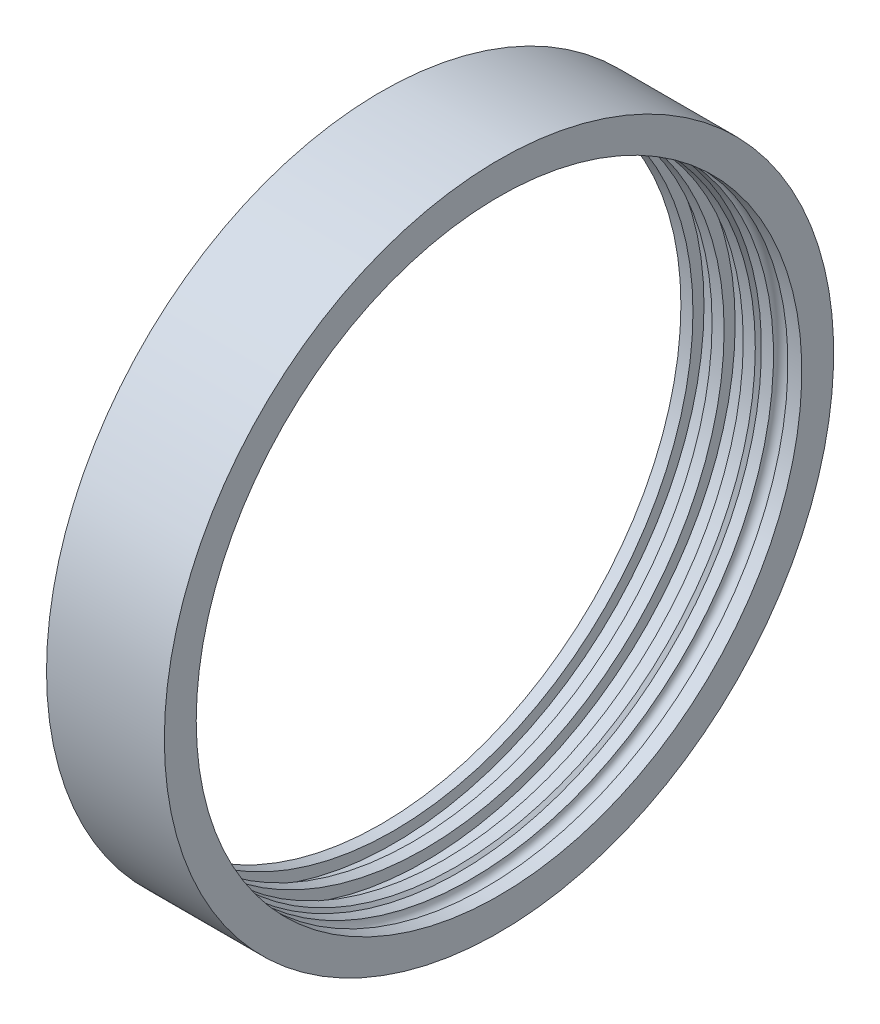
from build123d import *


with BuildPart() as part:
    # Sketch1 → Revolve1 (revolve)
    with BuildSketch(Plane(origin=(0, 0, 0), x_dir=(1, 0, 0), z_dir=(0, 1, 0)), mode=Mode.PRIVATE) as revolve1_sk:
        with BuildLine():
            Line((0, 83.185), (0, 74.4982))
            Line((0, 74.4982), (2.9972, 74.4982))
            Line((2.9972, 74.4982), (2.9972, 77.2414))
            Line((2.9972, 77.2414), (7.747, 77.2414))
            Line((7.747, 77.2414), (7.747, 74.4982))
            Line((7.747, 74.4982), (10.7442, 74.4982))
            Line((10.7442, 74.4982), (10.7442, 77.2414))
            Line((10.7442, 77.2414), (15.494, 77.2414))
            Line((15.494, 77.2414), (15.494, 74.4982))
            Line((15.494, 74.4982), (18.4912, 74.4982))
            Line((18.4912, 74.4982), (19.2532, 75.2602))
            Line((19.2532, 75.2602), (22.2504, 75.2602))
            ThreePointArc((22.2504, 75.2602), (24.0411, 77.0509), (25.8318, 75.2602))
            Line((25.8318, 75.2602), (29.2862, 75.2602))
            Line((29.2862, 75.2602), (29.2862, 83.185))
            Line((29.2862, 83.185), (0, 83.185))
        make_face()
    revolve(revolve1_sk.sketch.rotate(Axis((0, 0, 0), (1, 0, 0)), 180), axis=Axis((0, 0, 0), (1, 0, 0)))


solid = part.part
